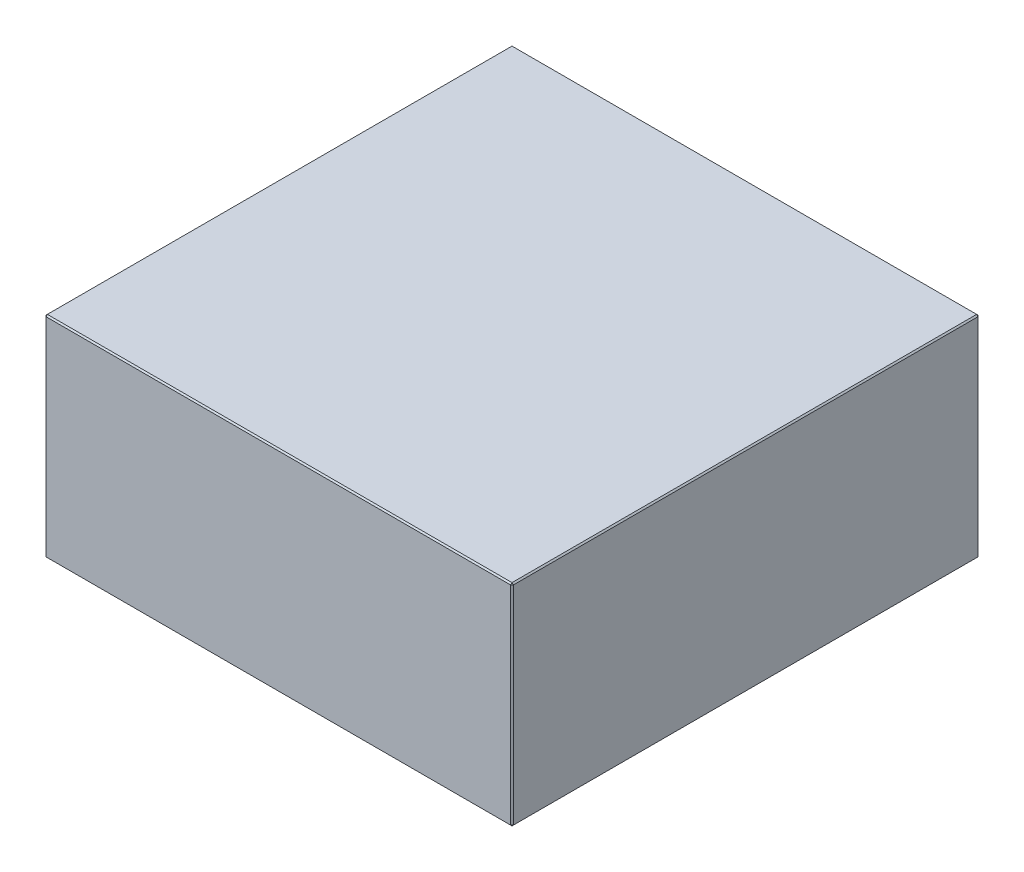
ISO-10303-21;
HEADER;
FILE_DESCRIPTION(('STEP AP214'),'2;1');
FILE_NAME('part.step','',(''),(''),'','','');
FILE_SCHEMA(('AUTOMOTIVE_DESIGN { 1 0 10303 214 1 1 1 1 }'));
ENDSEC;
DATA;
#1=APPLICATION_CONTEXT('core data for automotive mechanical design processes');
#2=APPLICATION_PROTOCOL_DEFINITION('international standard','automotive_design',2000,#1);
#3=PRODUCT_CONTEXT('',#1,'mechanical');
#4=PRODUCT('Part','Part','',(#3));
#5=PRODUCT_RELATED_PRODUCT_CATEGORY('part','',(#4));
#6=PRODUCT_DEFINITION_FORMATION('','',#4);
#7=PRODUCT_DEFINITION_CONTEXT('part definition',#1,'design');
#8=PRODUCT_DEFINITION('design','',#6,#7);
#9=PRODUCT_DEFINITION_SHAPE('','',#8);
#10=(LENGTH_UNIT() NAMED_UNIT(*) SI_UNIT(.MILLI.,.METRE.));
#11=(NAMED_UNIT(*) PLANE_ANGLE_UNIT() SI_UNIT($,.RADIAN.));
#12=(NAMED_UNIT(*) SI_UNIT($,.STERADIAN.) SOLID_ANGLE_UNIT());
#13=UNCERTAINTY_MEASURE_WITH_UNIT(LENGTH_MEASURE(1.E-05),#10,'distance_accuracy_value','');
#14=(GEOMETRIC_REPRESENTATION_CONTEXT(3) GLOBAL_UNCERTAINTY_ASSIGNED_CONTEXT((#13)) GLOBAL_UNIT_ASSIGNED_CONTEXT((#10,
#11,#12)) REPRESENTATION_CONTEXT('',''));
#15=CARTESIAN_POINT('',(0.,0.,0.));
#16=DIRECTION('',(0.,0.,1.));
#17=DIRECTION('',(1.,0.,0.));
#18=AXIS2_PLACEMENT_3D('',#15,#16,#17);
#19=CARTESIAN_POINT('',(-173.,156.,173.));
#20=DIRECTION('',(1.,0.,0.));
#21=DIRECTION('',(0.,0.,-1.));
#22=AXIS2_PLACEMENT_3D('',#19,#20,#21);
#23=PLANE('',#22);
#24=DIRECTION('',(0.,-1.,0.));
#25=VECTOR('',#24,1.);
#26=CARTESIAN_POINT('',(-173.,156.,-172.));
#27=LINE('',#26,#25);
#28=CARTESIAN_POINT('',(-173.,155.,-172.));
#29=VERTEX_POINT('',#28);
#30=CARTESIAN_POINT('',(-173.,1.,-172.));
#31=VERTEX_POINT('',#30);
#32=EDGE_CURVE('E114',#29,#31,#27,.T.);
#33=ORIENTED_EDGE('',*,*,#32,.T.);
#34=DIRECTION('',(0.,0.,1.));
#35=VECTOR('',#34,1.);
#36=CARTESIAN_POINT('',(-173.,1.,173.));
#37=LINE('',#36,#35);
#38=CARTESIAN_POINT('',(-173.,1.,172.));
#39=VERTEX_POINT('',#38);
#40=EDGE_CURVE('E110',#31,#39,#37,.T.);
#41=ORIENTED_EDGE('',*,*,#40,.T.);
#42=DIRECTION('',(0.,1.,0.));
#43=VECTOR('',#42,1.);
#44=CARTESIAN_POINT('',(-173.,156.,172.));
#45=LINE('',#44,#43);
#46=CARTESIAN_POINT('',(-173.,155.,172.));
#47=VERTEX_POINT('',#46);
#48=EDGE_CURVE('E103',#39,#47,#45,.T.);
#49=ORIENTED_EDGE('',*,*,#48,.T.);
#50=DIRECTION('',(0.,0.,-1.));
#51=VECTOR('',#50,1.);
#52=CARTESIAN_POINT('',(-173.,155.,-173.));
#53=LINE('',#52,#51);
#54=EDGE_CURVE('E107',#47,#29,#53,.T.);
#55=ORIENTED_EDGE('',*,*,#54,.T.);
#56=EDGE_LOOP('',(#33,#41,#49,#55));
#57=FACE_BOUND('',#56,.T.);
#58=ADVANCED_FACE('F15',(#57),#23,.F.);
#59=CARTESIAN_POINT('',(173.,156.,173.));
#60=DIRECTION('',(0.,0.,-1.));
#61=DIRECTION('',(-1.,0.,0.));
#62=AXIS2_PLACEMENT_3D('',#59,#60,#61);
#63=PLANE('',#62);
#64=DIRECTION('',(-1.,0.,0.));
#65=VECTOR('',#64,1.);
#66=CARTESIAN_POINT('',(-173.,155.,173.));
#67=LINE('',#66,#65);
#68=CARTESIAN_POINT('',(172.,155.,173.));
#69=VERTEX_POINT('',#68);
#70=CARTESIAN_POINT('',(-172.,155.,173.));
#71=VERTEX_POINT('',#70);
#72=EDGE_CURVE('E164',#69,#71,#67,.T.);
#73=ORIENTED_EDGE('',*,*,#72,.T.);
#74=DIRECTION('',(0.,-1.,0.));
#75=VECTOR('',#74,1.);
#76=CARTESIAN_POINT('',(-172.,156.,173.));
#77=LINE('',#76,#75);
#78=CARTESIAN_POINT('',(-172.,0.999999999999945,173.));
#79=VERTEX_POINT('',#78);
#80=EDGE_CURVE('E122',#71,#79,#77,.T.);
#81=ORIENTED_EDGE('',*,*,#80,.T.);
#82=DIRECTION('',(1.,0.,0.));
#83=VECTOR('',#82,1.);
#84=CARTESIAN_POINT('',(173.,0.999999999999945,173.));
#85=LINE('',#84,#83);
#86=CARTESIAN_POINT('',(172.,0.999999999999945,173.));
#87=VERTEX_POINT('',#86);
#88=EDGE_CURVE('E168',#79,#87,#85,.T.);
#89=ORIENTED_EDGE('',*,*,#88,.T.);
#90=DIRECTION('',(0.,1.,0.));
#91=VECTOR('',#90,1.);
#92=CARTESIAN_POINT('',(172.,156.,173.));
#93=LINE('',#92,#91);
#94=EDGE_CURVE('E166',#87,#69,#93,.T.);
#95=ORIENTED_EDGE('',*,*,#94,.T.);
#96=EDGE_LOOP('',(#73,#81,#89,#95));
#97=FACE_BOUND('',#96,.T.);
#98=ADVANCED_FACE('F275',(#97),#63,.F.);
#99=CARTESIAN_POINT('',(173.,156.,173.));
#100=DIRECTION('',(-1.,0.,0.));
#101=DIRECTION('',(0.,0.,1.));
#102=AXIS2_PLACEMENT_3D('',#99,#100,#101);
#103=PLANE('',#102);
#104=DIRECTION('',(0.,0.,-1.));
#105=VECTOR('',#104,1.);
#106=CARTESIAN_POINT('',(173.,0.999999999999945,173.));
#107=LINE('',#106,#105);
#108=CARTESIAN_POINT('',(173.,0.999999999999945,172.));
#109=VERTEX_POINT('',#108);
#110=CARTESIAN_POINT('',(173.,0.999999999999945,-172.));
#111=VERTEX_POINT('',#110);
#112=EDGE_CURVE('E159',#109,#111,#107,.T.);
#113=ORIENTED_EDGE('',*,*,#112,.T.);
#114=DIRECTION('',(0.,1.,0.));
#115=VECTOR('',#114,1.);
#116=CARTESIAN_POINT('',(173.,156.,-172.));
#117=LINE('',#116,#115);
#118=CARTESIAN_POINT('',(173.,155.,-172.));
#119=VERTEX_POINT('',#118);
#120=EDGE_CURVE('E161',#111,#119,#117,.T.);
#121=ORIENTED_EDGE('',*,*,#120,.T.);
#122=DIRECTION('',(0.,0.,1.));
#123=VECTOR('',#122,1.);
#124=CARTESIAN_POINT('',(173.,155.,173.));
#125=LINE('',#124,#123);
#126=CARTESIAN_POINT('',(173.,155.,172.));
#127=VERTEX_POINT('',#126);
#128=EDGE_CURVE('E155',#119,#127,#125,.T.);
#129=ORIENTED_EDGE('',*,*,#128,.T.);
#130=DIRECTION('',(0.,-1.,0.));
#131=VECTOR('',#130,1.);
#132=CARTESIAN_POINT('',(173.,156.,172.));
#133=LINE('',#132,#131);
#134=EDGE_CURVE('E157',#127,#109,#133,.T.);
#135=ORIENTED_EDGE('',*,*,#134,.T.);
#136=EDGE_LOOP('',(#113,#121,#129,#135));
#137=FACE_BOUND('',#136,.T.);
#138=ADVANCED_FACE('F254',(#137),#103,.F.);
#139=CARTESIAN_POINT('',(173.,156.,-173.));
#140=DIRECTION('',(0.,0.,1.));
#141=DIRECTION('',(1.,0.,0.));
#142=AXIS2_PLACEMENT_3D('',#139,#140,#141);
#143=PLANE('',#142);
#144=DIRECTION('',(0.,-1.,0.));
#145=VECTOR('',#144,1.);
#146=CARTESIAN_POINT('',(172.,156.,-173.));
#147=LINE('',#146,#145);
#148=CARTESIAN_POINT('',(172.,155.,-173.));
#149=VERTEX_POINT('',#148);
#150=CARTESIAN_POINT('',(172.,0.999999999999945,-173.));
#151=VERTEX_POINT('',#150);
#152=EDGE_CURVE('E148',#149,#151,#147,.T.);
#153=ORIENTED_EDGE('',*,*,#152,.T.);
#154=DIRECTION('',(-1.,0.,0.));
#155=VECTOR('',#154,1.);
#156=CARTESIAN_POINT('',(173.,0.999999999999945,-173.));
#157=LINE('',#156,#155);
#158=CARTESIAN_POINT('',(-172.,0.999999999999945,-173.));
#159=VERTEX_POINT('',#158);
#160=EDGE_CURVE('E153',#151,#159,#157,.T.);
#161=ORIENTED_EDGE('',*,*,#160,.T.);
#162=DIRECTION('',(0.,1.,0.));
#163=VECTOR('',#162,1.);
#164=CARTESIAN_POINT('',(-172.,156.,-173.));
#165=LINE('',#164,#163);
#166=CARTESIAN_POINT('',(-172.,155.,-173.));
#167=VERTEX_POINT('',#166);
#168=EDGE_CURVE('E150',#159,#167,#165,.T.);
#169=ORIENTED_EDGE('',*,*,#168,.T.);
#170=DIRECTION('',(1.,0.,0.));
#171=VECTOR('',#170,1.);
#172=CARTESIAN_POINT('',(173.,155.,-173.));
#173=LINE('',#172,#171);
#174=EDGE_CURVE('E146',#167,#149,#173,.T.);
#175=ORIENTED_EDGE('',*,*,#174,.T.);
#176=EDGE_LOOP('',(#153,#161,#169,#175));
#177=FACE_BOUND('',#176,.T.);
#178=ADVANCED_FACE('F284',(#177),#143,.F.);
#179=CARTESIAN_POINT('',(0.,156.,0.));
#180=DIRECTION('',(0.,1.,0.));
#181=DIRECTION('',(0.,0.,1.));
#182=AXIS2_PLACEMENT_3D('',#179,#180,#181);
#183=PLANE('',#182);
#184=DIRECTION('',(0.,0.,-1.));
#185=VECTOR('',#184,1.);
#186=CARTESIAN_POINT('',(172.,156.,-173.));
#187=LINE('',#186,#185);
#188=CARTESIAN_POINT('',(172.,156.,172.));
#189=VERTEX_POINT('',#188);
#190=CARTESIAN_POINT('',(172.,156.,-172.));
#191=VERTEX_POINT('',#190);
#192=EDGE_CURVE('E24',#189,#191,#187,.T.);
#193=ORIENTED_EDGE('',*,*,#192,.T.);
#194=DIRECTION('',(-1.,0.,0.));
#195=VECTOR('',#194,1.);
#196=CARTESIAN_POINT('',(-173.,156.,-172.));
#197=LINE('',#196,#195);
#198=CARTESIAN_POINT('',(-172.,156.,-172.));
#199=VERTEX_POINT('',#198);
#200=EDGE_CURVE('E9',#191,#199,#197,.T.);
#201=ORIENTED_EDGE('',*,*,#200,.T.);
#202=DIRECTION('',(0.,0.,1.));
#203=VECTOR('',#202,1.);
#204=CARTESIAN_POINT('',(-172.,156.,173.));
#205=LINE('',#204,#203);
#206=CARTESIAN_POINT('',(-172.,156.,172.));
#207=VERTEX_POINT('',#206);
#208=EDGE_CURVE('E180',#199,#207,#205,.T.);
#209=ORIENTED_EDGE('',*,*,#208,.T.);
#210=DIRECTION('',(1.,0.,0.));
#211=VECTOR('',#210,1.);
#212=CARTESIAN_POINT('',(173.,156.,172.));
#213=LINE('',#212,#211);
#214=EDGE_CURVE('E35',#207,#189,#213,.T.);
#215=ORIENTED_EDGE('',*,*,#214,.T.);
#216=EDGE_LOOP('',(#193,#201,#209,#215));
#217=FACE_BOUND('',#216,.T.);
#218=ADVANCED_FACE('F350',(#217),#183,.T.);
#219=CARTESIAN_POINT('',(0.,0.,0.));
#220=DIRECTION('',(0.,1.,0.));
#221=DIRECTION('',(0.,0.,1.));
#222=AXIS2_PLACEMENT_3D('',#219,#220,#221);
#223=PLANE('',#222);
#224=DIRECTION('',(0.,0.,1.));
#225=VECTOR('',#224,1.);
#226=CARTESIAN_POINT('',(172.,0.,0.));
#227=LINE('',#226,#225);
#228=CARTESIAN_POINT('',(172.,0.,-172.));
#229=VERTEX_POINT('',#228);
#230=CARTESIAN_POINT('',(172.,0.,172.));
#231=VERTEX_POINT('',#230);
#232=EDGE_CURVE('E171',#229,#231,#227,.T.);
#233=ORIENTED_EDGE('',*,*,#232,.T.);
#234=DIRECTION('',(-1.,0.,0.));
#235=VECTOR('',#234,1.);
#236=CARTESIAN_POINT('',(0.,0.,172.));
#237=LINE('',#236,#235);
#238=CARTESIAN_POINT('',(-172.,0.,172.));
#239=VERTEX_POINT('',#238);
#240=EDGE_CURVE('E177',#231,#239,#237,.T.);
#241=ORIENTED_EDGE('',*,*,#240,.T.);
#242=DIRECTION('',(0.,0.,-1.));
#243=VECTOR('',#242,1.);
#244=CARTESIAN_POINT('',(-172.,0.,0.));
#245=LINE('',#244,#243);
#246=CARTESIAN_POINT('',(-172.,0.,-172.));
#247=VERTEX_POINT('',#246);
#248=EDGE_CURVE('E175',#239,#247,#245,.T.);
#249=ORIENTED_EDGE('',*,*,#248,.T.);
#250=DIRECTION('',(1.,0.,0.));
#251=VECTOR('',#250,1.);
#252=CARTESIAN_POINT('',(0.,0.,-172.));
#253=LINE('',#252,#251);
#254=EDGE_CURVE('E173',#247,#229,#253,.T.);
#255=ORIENTED_EDGE('',*,*,#254,.T.);
#256=EDGE_LOOP('',(#233,#241,#249,#255));
#257=FACE_BOUND('',#256,.T.);
#258=ADVANCED_FACE('F246',(#257),#223,.F.);
#259=CARTESIAN_POINT('',(173.,156.,172.));
#260=DIRECTION('',(-0.707106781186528,0.,-0.707106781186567));
#261=DIRECTION('',(0.,-1.,0.));
#262=AXIS2_PLACEMENT_3D('',#259,#260,#261);
#263=PLANE('',#262);
#264=DIRECTION('',(-0.707106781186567,0.,0.707106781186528));
#265=VECTOR('',#264,1.);
#266=CARTESIAN_POINT('',(172.,155.,173.));
#267=LINE('',#266,#265);
#268=EDGE_CURVE('E19',#69,#127,#267,.F.);
#269=ORIENTED_EDGE('',*,*,#268,.F.);
#270=ORIENTED_EDGE('',*,*,#94,.F.);
#271=DIRECTION('',(0.707106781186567,0.,-0.707106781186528));
#272=VECTOR('',#271,1.);
#273=CARTESIAN_POINT('',(172.,0.999999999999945,173.));
#274=LINE('',#273,#272);
#275=EDGE_CURVE('E142',#109,#87,#274,.F.);
#276=ORIENTED_EDGE('',*,*,#275,.F.);
#277=ORIENTED_EDGE('',*,*,#134,.F.);
#278=EDGE_LOOP('',(#269,#270,#276,#277));
#279=FACE_BOUND('',#278,.T.);
#280=ADVANCED_FACE('F17',(#279),#263,.F.);
#281=CARTESIAN_POINT('',(172.,155.,173.));
#282=DIRECTION('',(0.577350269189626,0.577350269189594,0.577350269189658));
#283=DIRECTION('',(0.707106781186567,0.,-0.707106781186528));
#284=AXIS2_PLACEMENT_3D('',#281,#282,#283);
#285=PLANE('',#284);
#286=DIRECTION('',(0.,-0.707106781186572,0.707106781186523));
#287=VECTOR('',#286,1.);
#288=CARTESIAN_POINT('',(172.,155.,173.));
#289=LINE('',#288,#287);
#290=EDGE_CURVE('E226',#69,#189,#289,.F.);
#291=ORIENTED_EDGE('',*,*,#290,.F.);
#292=ORIENTED_EDGE('',*,*,#268,.T.);
#293=DIRECTION('',(-0.707106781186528,0.707106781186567,0.));
#294=VECTOR('',#293,1.);
#295=CARTESIAN_POINT('',(172.5,155.5,172.));
#296=LINE('',#295,#294);
#297=EDGE_CURVE('E228',#189,#127,#296,.F.);
#298=ORIENTED_EDGE('',*,*,#297,.F.);
#299=EDGE_LOOP('',(#291,#292,#298));
#300=FACE_BOUND('',#299,.T.);
#301=ADVANCED_FACE('F270',(#300),#285,.T.);
#302=CARTESIAN_POINT('',(172.,0.999999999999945,173.));
#303=DIRECTION('',(0.577350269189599,-0.577350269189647,0.577350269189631));
#304=DIRECTION('',(0.,-0.707106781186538,-0.707106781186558));
#305=AXIS2_PLACEMENT_3D('',#302,#303,#304);
#306=PLANE('',#305);
#307=DIRECTION('',(-0.707106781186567,-0.707106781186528,0.));
#308=VECTOR('',#307,1.);
#309=CARTESIAN_POINT('',(172.5,0.499999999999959,172.));
#310=LINE('',#309,#308);
#311=EDGE_CURVE('E220',#109,#231,#310,.T.);
#312=ORIENTED_EDGE('',*,*,#311,.F.);
#313=ORIENTED_EDGE('',*,*,#275,.T.);
#314=DIRECTION('',(0.,0.707106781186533,0.707106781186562));
#315=VECTOR('',#314,1.);
#316=CARTESIAN_POINT('',(172.,0.999999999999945,173.));
#317=LINE('',#316,#315);
#318=EDGE_CURVE('E223',#231,#87,#317,.T.);
#319=ORIENTED_EDGE('',*,*,#318,.F.);
#320=EDGE_LOOP('',(#312,#313,#319));
#321=FACE_BOUND('',#320,.T.);
#322=ADVANCED_FACE('F235',(#321),#306,.T.);
#323=CARTESIAN_POINT('',(172.,156.,0.));
#324=DIRECTION('',(0.707106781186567,0.707106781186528,0.));
#325=DIRECTION('',(0.,0.,1.));
#326=AXIS2_PLACEMENT_3D('',#323,#324,#325);
#327=PLANE('',#326);
#328=ORIENTED_EDGE('',*,*,#297,.T.);
#329=ORIENTED_EDGE('',*,*,#128,.F.);
#330=DIRECTION('',(0.707106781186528,-0.707106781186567,0.));
#331=VECTOR('',#330,1.);
#332=CARTESIAN_POINT('',(173.,155.,-172.));
#333=LINE('',#332,#331);
#334=EDGE_CURVE('E215',#191,#119,#333,.T.);
#335=ORIENTED_EDGE('',*,*,#334,.F.);
#336=ORIENTED_EDGE('',*,*,#192,.F.);
#337=EDGE_LOOP('',(#328,#329,#335,#336));
#338=FACE_BOUND('',#337,.T.);
#339=ADVANCED_FACE('F265',(#338),#327,.T.);
#340=CARTESIAN_POINT('',(0.,156.,172.));
#341=DIRECTION('',(0.,0.707106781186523,0.707106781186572));
#342=DIRECTION('',(-1.,0.,0.));
#343=AXIS2_PLACEMENT_3D('',#340,#341,#342);
#344=PLANE('',#343);
#345=ORIENTED_EDGE('',*,*,#290,.T.);
#346=ORIENTED_EDGE('',*,*,#214,.F.);
#347=DIRECTION('',(0.,0.707106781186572,-0.707106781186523));
#348=VECTOR('',#347,1.);
#349=CARTESIAN_POINT('',(-172.,155.5,172.5));
#350=LINE('',#349,#348);
#351=EDGE_CURVE('E126',#71,#207,#350,.T.);
#352=ORIENTED_EDGE('',*,*,#351,.F.);
#353=ORIENTED_EDGE('',*,*,#72,.F.);
#354=EDGE_LOOP('',(#345,#346,#352,#353));
#355=FACE_BOUND('',#354,.T.);
#356=ADVANCED_FACE('F273',(#355),#344,.T.);
#357=CARTESIAN_POINT('',(-172.,156.,173.));
#358=DIRECTION('',(0.707106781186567,0.,-0.707106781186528));
#359=DIRECTION('',(0.,-1.,0.));
#360=AXIS2_PLACEMENT_3D('',#357,#358,#359);
#361=PLANE('',#360);
#362=DIRECTION('',(0.707106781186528,0.,0.707106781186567));
#363=VECTOR('',#362,1.);
#364=CARTESIAN_POINT('',(-172.,0.999999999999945,173.));
#365=LINE('',#364,#363);
#366=EDGE_CURVE('E127',#79,#39,#365,.F.);
#367=ORIENTED_EDGE('',*,*,#366,.F.);
#368=ORIENTED_EDGE('',*,*,#80,.F.);
#369=DIRECTION('',(-0.707106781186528,0.,-0.707106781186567));
#370=VECTOR('',#369,1.);
#371=CARTESIAN_POINT('',(-173.,155.,172.));
#372=LINE('',#371,#370);
#373=EDGE_CURVE('E118',#47,#71,#372,.F.);
#374=ORIENTED_EDGE('',*,*,#373,.F.);
#375=ORIENTED_EDGE('',*,*,#48,.F.);
#376=EDGE_LOOP('',(#367,#368,#374,#375));
#377=FACE_BOUND('',#376,.T.);
#378=ADVANCED_FACE('F120',(#377),#361,.F.);
#379=CARTESIAN_POINT('',(173.,0.999999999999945,173.));
#380=DIRECTION('',(0.,0.707106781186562,-0.707106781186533));
#381=DIRECTION('',(1.,0.,0.));
#382=AXIS2_PLACEMENT_3D('',#379,#380,#381);
#383=PLANE('',#382);
#384=ORIENTED_EDGE('',*,*,#318,.T.);
#385=ORIENTED_EDGE('',*,*,#88,.F.);
#386=DIRECTION('',(0.,-0.707106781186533,-0.707106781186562));
#387=VECTOR('',#386,1.);
#388=CARTESIAN_POINT('',(-172.,0.999999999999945,173.));
#389=LINE('',#388,#387);
#390=EDGE_CURVE('E211',#239,#79,#389,.F.);
#391=ORIENTED_EDGE('',*,*,#390,.F.);
#392=ORIENTED_EDGE('',*,*,#240,.F.);
#393=EDGE_LOOP('',(#384,#385,#391,#392));
#394=FACE_BOUND('',#393,.T.);
#395=ADVANCED_FACE('F243',(#394),#383,.F.);
#396=CARTESIAN_POINT('',(173.,0.999999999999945,173.));
#397=DIRECTION('',(-0.707106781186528,0.707106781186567,0.));
#398=DIRECTION('',(0.,0.,-1.));
#399=AXIS2_PLACEMENT_3D('',#396,#397,#398);
#400=PLANE('',#399);
#401=ORIENTED_EDGE('',*,*,#311,.T.);
#402=ORIENTED_EDGE('',*,*,#232,.F.);
#403=DIRECTION('',(0.707106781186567,0.707106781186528,0.));
#404=VECTOR('',#403,1.);
#405=CARTESIAN_POINT('',(172.5,0.499999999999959,-172.));
#406=LINE('',#405,#404);
#407=EDGE_CURVE('E208',#111,#229,#406,.F.);
#408=ORIENTED_EDGE('',*,*,#407,.F.);
#409=ORIENTED_EDGE('',*,*,#112,.F.);
#410=EDGE_LOOP('',(#401,#402,#408,#409));
#411=FACE_BOUND('',#410,.T.);
#412=ADVANCED_FACE('F251',(#411),#400,.F.);
#413=CARTESIAN_POINT('',(172.,156.,-173.));
#414=DIRECTION('',(-0.707106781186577,0.,0.707106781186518));
#415=DIRECTION('',(0.,-1.,0.));
#416=AXIS2_PLACEMENT_3D('',#413,#414,#415);
#417=PLANE('',#416);
#418=DIRECTION('',(0.707106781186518,0.,0.707106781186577));
#419=VECTOR('',#418,1.);
#420=CARTESIAN_POINT('',(173.,155.,-172.));
#421=LINE('',#420,#419);
#422=EDGE_CURVE('E217',#119,#149,#421,.F.);
#423=ORIENTED_EDGE('',*,*,#422,.F.);
#424=ORIENTED_EDGE('',*,*,#120,.F.);
#425=DIRECTION('',(-0.707106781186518,0.,-0.707106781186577));
#426=VECTOR('',#425,1.);
#427=CARTESIAN_POINT('',(172.,0.999999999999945,-173.));
#428=LINE('',#427,#426);
#429=EDGE_CURVE('E205',#151,#111,#428,.F.);
#430=ORIENTED_EDGE('',*,*,#429,.F.);
#431=ORIENTED_EDGE('',*,*,#152,.F.);
#432=EDGE_LOOP('',(#423,#424,#430,#431));
#433=FACE_BOUND('',#432,.T.);
#434=ADVANCED_FACE('F258',(#433),#417,.F.);
#435=CARTESIAN_POINT('',(173.,155.,-172.));
#436=DIRECTION('',(0.577350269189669,0.577350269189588,-0.57735026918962));
#437=DIRECTION('',(-0.707106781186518,0.,-0.707106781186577));
#438=AXIS2_PLACEMENT_3D('',#435,#436,#437);
#439=PLANE('',#438);
#440=ORIENTED_EDGE('',*,*,#334,.T.);
#441=ORIENTED_EDGE('',*,*,#422,.T.);
#442=DIRECTION('',(0.,0.707106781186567,0.707106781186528));
#443=VECTOR('',#442,1.);
#444=CARTESIAN_POINT('',(172.,155.5,-172.5));
#445=LINE('',#444,#443);
#446=EDGE_CURVE('E134',#191,#149,#445,.F.);
#447=ORIENTED_EDGE('',*,*,#446,.F.);
#448=EDGE_LOOP('',(#440,#441,#447));
#449=FACE_BOUND('',#448,.T.);
#450=ADVANCED_FACE('F325',(#449),#439,.T.);
#451=CARTESIAN_POINT('',(-173.,155.,172.));
#452=DIRECTION('',(-0.577350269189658,0.577350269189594,0.577350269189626));
#453=DIRECTION('',(0.707106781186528,0.,0.707106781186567));
#454=AXIS2_PLACEMENT_3D('',#451,#452,#453);
#455=PLANE('',#454);
#456=ORIENTED_EDGE('',*,*,#373,.T.);
#457=ORIENTED_EDGE('',*,*,#351,.T.);
#458=DIRECTION('',(-0.707106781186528,-0.707106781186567,0.));
#459=VECTOR('',#458,1.);
#460=CARTESIAN_POINT('',(-173.,155.,172.));
#461=LINE('',#460,#459);
#462=EDGE_CURVE('E130',#47,#207,#461,.F.);
#463=ORIENTED_EDGE('',*,*,#462,.F.);
#464=EDGE_LOOP('',(#456,#457,#463));
#465=FACE_BOUND('',#464,.T.);
#466=ADVANCED_FACE('F131',(#465),#455,.T.);
#467=CARTESIAN_POINT('',(-172.,0.999999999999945,173.));
#468=DIRECTION('',(-0.577350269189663,-0.577350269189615,0.577350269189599));
#469=DIRECTION('',(0.707106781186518,-0.707106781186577,0.));
#470=AXIS2_PLACEMENT_3D('',#467,#468,#469);
#471=PLANE('',#470);
#472=ORIENTED_EDGE('',*,*,#390,.T.);
#473=ORIENTED_EDGE('',*,*,#366,.T.);
#474=DIRECTION('',(-0.707106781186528,0.707106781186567,0.));
#475=VECTOR('',#474,1.);
#476=CARTESIAN_POINT('',(-172.5,0.499999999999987,172.));
#477=LINE('',#476,#475);
#478=EDGE_CURVE('E135',#239,#39,#477,.T.);
#479=ORIENTED_EDGE('',*,*,#478,.F.);
#480=EDGE_LOOP('',(#472,#473,#479));
#481=FACE_BOUND('',#480,.T.);
#482=ADVANCED_FACE('F318',(#481),#471,.T.);
#483=CARTESIAN_POINT('',(172.,0.999999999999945,-173.));
#484=DIRECTION('',(0.577350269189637,-0.577350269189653,-0.577350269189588));
#485=DIRECTION('',(0.707106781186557,0.707106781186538,0.));
#486=AXIS2_PLACEMENT_3D('',#483,#484,#485);
#487=PLANE('',#486);
#488=ORIENTED_EDGE('',*,*,#429,.T.);
#489=ORIENTED_EDGE('',*,*,#407,.T.);
#490=DIRECTION('',(0.,-0.707106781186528,0.707106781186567));
#491=VECTOR('',#490,1.);
#492=CARTESIAN_POINT('',(172.,0.999999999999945,-173.));
#493=LINE('',#492,#491);
#494=EDGE_CURVE('E198',#151,#229,#493,.T.);
#495=ORIENTED_EDGE('',*,*,#494,.F.);
#496=EDGE_LOOP('',(#488,#489,#495));
#497=FACE_BOUND('',#496,.T.);
#498=ADVANCED_FACE('F314',(#497),#487,.T.);
#499=CARTESIAN_POINT('',(0.,156.,-172.));
#500=DIRECTION('',(0.,0.707106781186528,-0.707106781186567));
#501=DIRECTION('',(1.,0.,0.));
#502=AXIS2_PLACEMENT_3D('',#499,#500,#501);
#503=PLANE('',#502);
#504=ORIENTED_EDGE('',*,*,#446,.T.);
#505=ORIENTED_EDGE('',*,*,#174,.F.);
#506=DIRECTION('',(0.,-0.707106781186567,-0.707106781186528));
#507=VECTOR('',#506,1.);
#508=CARTESIAN_POINT('',(-172.,155.,-173.));
#509=LINE('',#508,#507);
#510=EDGE_CURVE('E195',#199,#167,#509,.T.);
#511=ORIENTED_EDGE('',*,*,#510,.F.);
#512=ORIENTED_EDGE('',*,*,#200,.F.);
#513=EDGE_LOOP('',(#504,#505,#511,#512));
#514=FACE_BOUND('',#513,.T.);
#515=ADVANCED_FACE('F311',(#514),#503,.T.);
#516=CARTESIAN_POINT('',(-172.,156.,0.));
#517=DIRECTION('',(-0.707106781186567,0.707106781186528,0.));
#518=DIRECTION('',(0.,0.,-1.));
#519=AXIS2_PLACEMENT_3D('',#516,#517,#518);
#520=PLANE('',#519);
#521=ORIENTED_EDGE('',*,*,#462,.T.);
#522=ORIENTED_EDGE('',*,*,#208,.F.);
#523=DIRECTION('',(0.707106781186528,0.707106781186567,0.));
#524=VECTOR('',#523,1.);
#525=CARTESIAN_POINT('',(-172.5,155.5,-172.));
#526=LINE('',#525,#524);
#527=EDGE_CURVE('E138',#29,#199,#526,.T.);
#528=ORIENTED_EDGE('',*,*,#527,.F.);
#529=ORIENTED_EDGE('',*,*,#54,.F.);
#530=EDGE_LOOP('',(#521,#522,#528,#529));
#531=FACE_BOUND('',#530,.T.);
#532=ADVANCED_FACE('F137',(#531),#520,.T.);
#533=CARTESIAN_POINT('',(-173.,1.,173.));
#534=DIRECTION('',(0.707106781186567,0.707106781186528,0.));
#535=DIRECTION('',(0.,0.,1.));
#536=AXIS2_PLACEMENT_3D('',#533,#534,#535);
#537=PLANE('',#536);
#538=ORIENTED_EDGE('',*,*,#478,.T.);
#539=ORIENTED_EDGE('',*,*,#40,.F.);
#540=DIRECTION('',(0.707106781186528,-0.707106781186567,0.));
#541=VECTOR('',#540,1.);
#542=CARTESIAN_POINT('',(-173.,1.,-172.));
#543=LINE('',#542,#541);
#544=EDGE_CURVE('E191',#247,#31,#543,.F.);
#545=ORIENTED_EDGE('',*,*,#544,.F.);
#546=ORIENTED_EDGE('',*,*,#248,.F.);
#547=EDGE_LOOP('',(#538,#539,#545,#546));
#548=FACE_BOUND('',#547,.T.);
#549=ADVANCED_FACE('F304',(#548),#537,.F.);
#550=CARTESIAN_POINT('',(173.,0.999999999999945,-173.));
#551=DIRECTION('',(0.,0.707106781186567,0.707106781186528));
#552=DIRECTION('',(-1.,0.,0.));
#553=AXIS2_PLACEMENT_3D('',#550,#551,#552);
#554=PLANE('',#553);
#555=ORIENTED_EDGE('',*,*,#494,.T.);
#556=ORIENTED_EDGE('',*,*,#254,.F.);
#557=DIRECTION('',(0.,0.707106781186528,-0.707106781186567));
#558=VECTOR('',#557,1.);
#559=CARTESIAN_POINT('',(-172.,0.499999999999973,-172.5));
#560=LINE('',#559,#558);
#561=EDGE_CURVE('E188',#159,#247,#560,.F.);
#562=ORIENTED_EDGE('',*,*,#561,.F.);
#563=ORIENTED_EDGE('',*,*,#160,.F.);
#564=EDGE_LOOP('',(#555,#556,#562,#563));
#565=FACE_BOUND('',#564,.T.);
#566=ADVANCED_FACE('F300',(#565),#554,.F.);
#567=CARTESIAN_POINT('',(-172.,155.,-173.));
#568=DIRECTION('',(-0.577350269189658,0.577350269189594,-0.577350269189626));
#569=DIRECTION('',(-0.707106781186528,0.,0.707106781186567));
#570=AXIS2_PLACEMENT_3D('',#567,#568,#569);
#571=PLANE('',#570);
#572=ORIENTED_EDGE('',*,*,#527,.T.);
#573=ORIENTED_EDGE('',*,*,#510,.T.);
#574=DIRECTION('',(0.707106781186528,0.,-0.707106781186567));
#575=VECTOR('',#574,1.);
#576=CARTESIAN_POINT('',(-172.,155.,-173.));
#577=LINE('',#576,#575);
#578=EDGE_CURVE('E186',#29,#167,#577,.T.);
#579=ORIENTED_EDGE('',*,*,#578,.F.);
#580=EDGE_LOOP('',(#572,#573,#579));
#581=FACE_BOUND('',#580,.T.);
#582=ADVANCED_FACE('F296',(#581),#571,.T.);
#583=CARTESIAN_POINT('',(-173.,1.,-172.));
#584=DIRECTION('',(-0.577350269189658,-0.577350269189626,-0.577350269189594));
#585=DIRECTION('',(0.707106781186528,-0.707106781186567,0.));
#586=AXIS2_PLACEMENT_3D('',#583,#584,#585);
#587=PLANE('',#586);
#588=ORIENTED_EDGE('',*,*,#561,.T.);
#589=ORIENTED_EDGE('',*,*,#544,.T.);
#590=DIRECTION('',(-0.707106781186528,0.,0.707106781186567));
#591=VECTOR('',#590,1.);
#592=CARTESIAN_POINT('',(-173.,1.,-172.));
#593=LINE('',#592,#591);
#594=EDGE_CURVE('E184',#159,#31,#593,.T.);
#595=ORIENTED_EDGE('',*,*,#594,.F.);
#596=EDGE_LOOP('',(#588,#589,#595));
#597=FACE_BOUND('',#596,.T.);
#598=ADVANCED_FACE('F292',(#597),#587,.T.);
#599=CARTESIAN_POINT('',(-173.,156.,-172.));
#600=DIRECTION('',(0.707106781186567,0.,0.707106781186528));
#601=DIRECTION('',(0.,-1.,0.));
#602=AXIS2_PLACEMENT_3D('',#599,#600,#601);
#603=PLANE('',#602);
#604=ORIENTED_EDGE('',*,*,#578,.T.);
#605=ORIENTED_EDGE('',*,*,#168,.F.);
#606=ORIENTED_EDGE('',*,*,#594,.T.);
#607=ORIENTED_EDGE('',*,*,#32,.F.);
#608=EDGE_LOOP('',(#604,#605,#606,#607));
#609=FACE_BOUND('',#608,.T.);
#610=ADVANCED_FACE('F289',(#609),#603,.F.);
#611=CLOSED_SHELL('',(#58,#98,#138,#178,#218,#258,#280,#301,#322,#339,#356,#378,#395,#412,#434,
#450,#466,#482,#498,#515,#532,#549,#566,#582,#598,#610));
#612=MANIFOLD_SOLID_BREP('B1',#611);
#613=ADVANCED_BREP_SHAPE_REPRESENTATION('',(#18,#612),#14);
#614=SHAPE_DEFINITION_REPRESENTATION(#9,#613);
ENDSEC;
END-ISO-10303-21;
